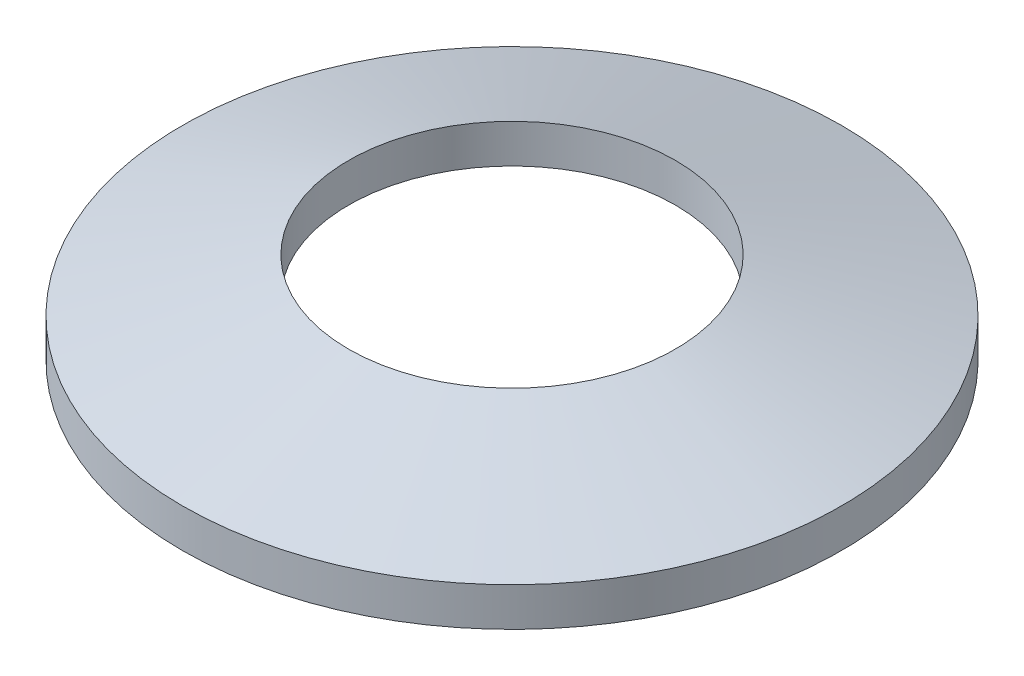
ISO-10303-21;
HEADER;
FILE_DESCRIPTION(('STEP AP214'),'2;1');
FILE_NAME('part.step','',(''),(''),'','','');
FILE_SCHEMA(('AUTOMOTIVE_DESIGN { 1 0 10303 214 1 1 1 1 }'));
ENDSEC;
DATA;
#1=APPLICATION_CONTEXT('core data for automotive mechanical design processes');
#2=APPLICATION_PROTOCOL_DEFINITION('international standard','automotive_design',2000,#1);
#3=PRODUCT_CONTEXT('',#1,'mechanical');
#4=PRODUCT('Part','Part','',(#3));
#5=PRODUCT_RELATED_PRODUCT_CATEGORY('part','',(#4));
#6=PRODUCT_DEFINITION_FORMATION('','',#4);
#7=PRODUCT_DEFINITION_CONTEXT('part definition',#1,'design');
#8=PRODUCT_DEFINITION('design','',#6,#7);
#9=PRODUCT_DEFINITION_SHAPE('','',#8);
#10=(LENGTH_UNIT() NAMED_UNIT(*) SI_UNIT(.MILLI.,.METRE.));
#11=(NAMED_UNIT(*) PLANE_ANGLE_UNIT() SI_UNIT($,.RADIAN.));
#12=(NAMED_UNIT(*) SI_UNIT($,.STERADIAN.) SOLID_ANGLE_UNIT());
#13=UNCERTAINTY_MEASURE_WITH_UNIT(LENGTH_MEASURE(1.E-05),#10,'distance_accuracy_value','');
#14=(GEOMETRIC_REPRESENTATION_CONTEXT(3) GLOBAL_UNCERTAINTY_ASSIGNED_CONTEXT((#13)) GLOBAL_UNIT_ASSIGNED_CONTEXT((#10,
#11,#12)) REPRESENTATION_CONTEXT('',''));
#15=CARTESIAN_POINT('',(0.,0.,0.));
#16=DIRECTION('',(0.,0.,1.));
#17=DIRECTION('',(1.,0.,0.));
#18=AXIS2_PLACEMENT_3D('',#15,#16,#17);
#19=CARTESIAN_POINT('',(0.,21.2683979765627,0.));
#20=DIRECTION('',(0.,1.,0.));
#21=DIRECTION('',(0.,0.,1.));
#22=AXIS2_PLACEMENT_3D('',#19,#20,#21);
#23=CYLINDRICAL_SURFACE('',#22,6.25);
#24=CARTESIAN_POINT('',(0.,0.,0.));
#25=DIRECTION('',(0.,1.,0.));
#26=DIRECTION('',(0.,0.,1.));
#27=AXIS2_PLACEMENT_3D('',#24,#25,#26);
#28=CIRCLE('',#27,6.25);
#29=CARTESIAN_POINT('',(0.,0.,6.25));
#30=VERTEX_POINT('',#29);
#31=EDGE_CURVE('E10',#30,#30,#28,.T.);
#32=ORIENTED_EDGE('',*,*,#31,.T.);
#33=EDGE_LOOP('',(#32));
#34=FACE_BOUND('',#33,.T.);
#35=CARTESIAN_POINT('',(0.,0.734426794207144,0.));
#36=DIRECTION('',(0.,1.,0.));
#37=DIRECTION('',(0.,0.,1.));
#38=AXIS2_PLACEMENT_3D('',#35,#36,#37);
#39=CIRCLE('',#38,6.25);
#40=CARTESIAN_POINT('',(0.,0.734426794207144,6.25));
#41=VERTEX_POINT('',#40);
#42=EDGE_CURVE('E44',#41,#41,#39,.T.);
#43=ORIENTED_EDGE('',*,*,#42,.F.);
#44=EDGE_LOOP('',(#43));
#45=FACE_BOUND('',#44,.T.);
#46=ADVANCED_FACE('F30',(#34,#45),#23,.T.);
#47=CARTESIAN_POINT('',(0.,0.,0.));
#48=DIRECTION('',(0.,-1.,0.));
#49=DIRECTION('',(0.,0.,-1.));
#50=AXIS2_PLACEMENT_3D('',#47,#48,#49);
#51=CONICAL_SURFACE('',#50,6.25,1.26339885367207);
#52=CARTESIAN_POINT('',(0.,1.,0.));
#53=DIRECTION('',(0.,1.,0.));
#54=DIRECTION('',(0.,0.,1.));
#55=AXIS2_PLACEMENT_3D('',#52,#53,#54);
#56=CIRCLE('',#55,3.1);
#57=CARTESIAN_POINT('',(0.,1.,3.1));
#58=VERTEX_POINT('',#57);
#59=EDGE_CURVE('E36',#58,#58,#56,.T.);
#60=ORIENTED_EDGE('',*,*,#59,.T.);
#61=EDGE_LOOP('',(#60));
#62=FACE_BOUND('',#61,.T.);
#63=ORIENTED_EDGE('',*,*,#31,.F.);
#64=EDGE_LOOP('',(#63));
#65=FACE_BOUND('',#64,.T.);
#66=ADVANCED_FACE('F54',(#62,#65),#51,.F.);
#67=CARTESIAN_POINT('',(0.,21.2683979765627,0.));
#68=DIRECTION('',(0.,1.,0.));
#69=DIRECTION('',(0.,0.,1.));
#70=AXIS2_PLACEMENT_3D('',#67,#68,#69);
#71=CYLINDRICAL_SURFACE('',#70,3.1);
#72=CARTESIAN_POINT('',(0.,1.73442679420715,0.));
#73=DIRECTION('',(0.,1.,0.));
#74=DIRECTION('',(0.,0.,1.));
#75=AXIS2_PLACEMENT_3D('',#72,#73,#74);
#76=CIRCLE('',#75,3.1);
#77=CARTESIAN_POINT('',(0.,1.73442679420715,3.1));
#78=VERTEX_POINT('',#77);
#79=EDGE_CURVE('E40',#78,#78,#76,.T.);
#80=ORIENTED_EDGE('',*,*,#79,.T.);
#81=EDGE_LOOP('',(#80));
#82=FACE_BOUND('',#81,.T.);
#83=ORIENTED_EDGE('',*,*,#59,.F.);
#84=EDGE_LOOP('',(#83));
#85=FACE_BOUND('',#84,.T.);
#86=ADVANCED_FACE('F58',(#82,#85),#71,.F.);
#87=CARTESIAN_POINT('',(0.,1.73442679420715,0.));
#88=DIRECTION('',(0.,-1.,0.));
#89=DIRECTION('',(0.,0.,-1.));
#90=AXIS2_PLACEMENT_3D('',#87,#88,#89);
#91=CONICAL_SURFACE('',#90,3.1,1.26339885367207);
#92=ORIENTED_EDGE('',*,*,#42,.T.);
#93=EDGE_LOOP('',(#92));
#94=FACE_BOUND('',#93,.T.);
#95=ORIENTED_EDGE('',*,*,#79,.F.);
#96=EDGE_LOOP('',(#95));
#97=FACE_BOUND('',#96,.T.);
#98=ADVANCED_FACE('F50',(#94,#97),#91,.T.);
#99=CLOSED_SHELL('',(#46,#66,#86,#98));
#100=MANIFOLD_SOLID_BREP('B2',#99);
#101=ADVANCED_BREP_SHAPE_REPRESENTATION('',(#18,#100),#14);
#102=SHAPE_DEFINITION_REPRESENTATION(#9,#101);
ENDSEC;
END-ISO-10303-21;
